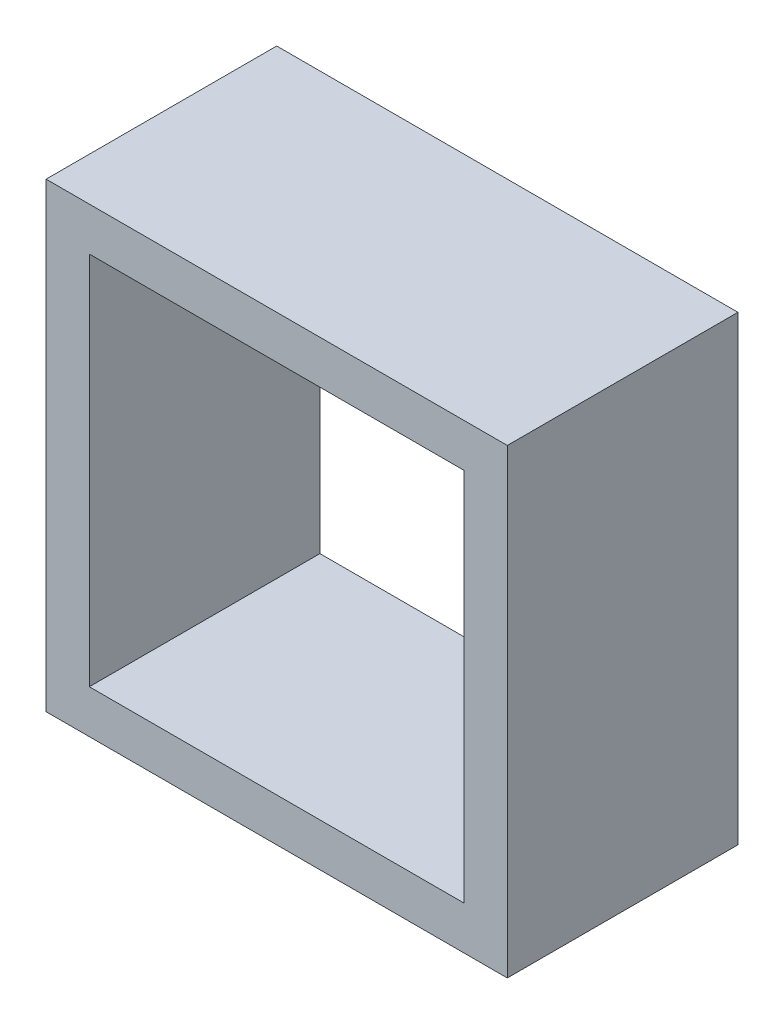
ISO-10303-21;
HEADER;
FILE_DESCRIPTION(('STEP AP214'),'2;1');
FILE_NAME('part.step','',(''),(''),'','','');
FILE_SCHEMA(('AUTOMOTIVE_DESIGN { 1 0 10303 214 1 1 1 1 }'));
ENDSEC;
DATA;
#1=APPLICATION_CONTEXT('core data for automotive mechanical design processes');
#2=APPLICATION_PROTOCOL_DEFINITION('international standard','automotive_design',2000,#1);
#3=PRODUCT_CONTEXT('',#1,'mechanical');
#4=PRODUCT('Part','Part','',(#3));
#5=PRODUCT_RELATED_PRODUCT_CATEGORY('part','',(#4));
#6=PRODUCT_DEFINITION_FORMATION('','',#4);
#7=PRODUCT_DEFINITION_CONTEXT('part definition',#1,'design');
#8=PRODUCT_DEFINITION('design','',#6,#7);
#9=PRODUCT_DEFINITION_SHAPE('','',#8);
#10=(LENGTH_UNIT() NAMED_UNIT(*) SI_UNIT(.MILLI.,.METRE.));
#11=(NAMED_UNIT(*) PLANE_ANGLE_UNIT() SI_UNIT($,.RADIAN.));
#12=(NAMED_UNIT(*) SI_UNIT($,.STERADIAN.) SOLID_ANGLE_UNIT());
#13=UNCERTAINTY_MEASURE_WITH_UNIT(LENGTH_MEASURE(1.E-05),#10,'distance_accuracy_value','');
#14=(GEOMETRIC_REPRESENTATION_CONTEXT(3) GLOBAL_UNCERTAINTY_ASSIGNED_CONTEXT((#13)) GLOBAL_UNIT_ASSIGNED_CONTEXT((#10,
#11,#12)) REPRESENTATION_CONTEXT('',''));
#15=CARTESIAN_POINT('',(0.,0.,0.));
#16=DIRECTION('',(0.,0.,1.));
#17=DIRECTION('',(1.,0.,0.));
#18=AXIS2_PLACEMENT_3D('',#15,#16,#17);
#19=CARTESIAN_POINT('',(50.799956,50.799956,12.7));
#20=DIRECTION('',(0.,0.,-1.));
#21=DIRECTION('',(-1.,0.,0.));
#22=AXIS2_PLACEMENT_3D('',#19,#20,#21);
#23=PLANE('',#22);
#24=DIRECTION('',(0.,1.,0.));
#25=VECTOR('',#24,1.);
#26=CARTESIAN_POINT('',(50.799956,50.799956,12.7));
#27=LINE('',#26,#25);
#28=CARTESIAN_POINT('',(50.7999560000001,0.,12.7));
#29=VERTEX_POINT('',#28);
#30=CARTESIAN_POINT('',(50.799956,50.799956,12.7));
#31=VERTEX_POINT('',#30);
#32=EDGE_CURVE('E133',#29,#31,#27,.T.);
#33=ORIENTED_EDGE('',*,*,#32,.T.);
#34=DIRECTION('',(-1.,0.,0.));
#35=VECTOR('',#34,1.);
#36=CARTESIAN_POINT('',(50.799956,50.799956,12.7));
#37=LINE('',#36,#35);
#38=CARTESIAN_POINT('',(0.,50.799956,12.7));
#39=VERTEX_POINT('',#38);
#40=EDGE_CURVE('E136',#31,#39,#37,.T.);
#41=ORIENTED_EDGE('',*,*,#40,.T.);
#42=DIRECTION('',(0.,-1.,0.));
#43=VECTOR('',#42,1.);
#44=CARTESIAN_POINT('',(0.,0.,12.7));
#45=LINE('',#44,#43);
#46=CARTESIAN_POINT('',(0.,0.,12.7));
#47=VERTEX_POINT('',#46);
#48=EDGE_CURVE('E139',#39,#47,#45,.T.);
#49=ORIENTED_EDGE('',*,*,#48,.T.);
#50=DIRECTION('',(1.,0.,0.));
#51=VECTOR('',#50,1.);
#52=CARTESIAN_POINT('',(0.,0.,12.7));
#53=LINE('',#52,#51);
#54=EDGE_CURVE('E141',#47,#29,#53,.T.);
#55=ORIENTED_EDGE('',*,*,#54,.T.);
#56=EDGE_LOOP('',(#33,#41,#49,#55));
#57=FACE_BOUND('',#56,.T.);
#58=DIRECTION('',(1.,0.,0.));
#59=VECTOR('',#58,1.);
#60=CARTESIAN_POINT('',(4.7625,4.7625,12.7));
#61=LINE('',#60,#59);
#62=CARTESIAN_POINT('',(4.7625,4.7625,12.7));
#63=VERTEX_POINT('',#62);
#64=CARTESIAN_POINT('',(46.0374560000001,4.7625,12.7));
#65=VERTEX_POINT('',#64);
#66=EDGE_CURVE('E97',#63,#65,#61,.T.);
#67=ORIENTED_EDGE('',*,*,#66,.F.);
#68=DIRECTION('',(0.,-1.,0.));
#69=VECTOR('',#68,1.);
#70=CARTESIAN_POINT('',(4.7625,4.7625,12.7));
#71=LINE('',#70,#69);
#72=CARTESIAN_POINT('',(4.7625,46.037456,12.7));
#73=VERTEX_POINT('',#72);
#74=EDGE_CURVE('E119',#73,#63,#71,.T.);
#75=ORIENTED_EDGE('',*,*,#74,.F.);
#76=DIRECTION('',(-1.,0.,0.));
#77=VECTOR('',#76,1.);
#78=CARTESIAN_POINT('',(46.037456,46.037456,12.7));
#79=LINE('',#78,#77);
#80=CARTESIAN_POINT('',(46.037456,46.037456,12.7));
#81=VERTEX_POINT('',#80);
#82=EDGE_CURVE('E117',#81,#73,#79,.T.);
#83=ORIENTED_EDGE('',*,*,#82,.F.);
#84=DIRECTION('',(0.,1.,0.));
#85=VECTOR('',#84,1.);
#86=CARTESIAN_POINT('',(46.037456,46.037456,12.7));
#87=LINE('',#86,#85);
#88=EDGE_CURVE('E105',#65,#81,#87,.T.);
#89=ORIENTED_EDGE('',*,*,#88,.F.);
#90=EDGE_LOOP('',(#67,#75,#83,#89));
#91=FACE_BOUND('',#90,.T.);
#92=ADVANCED_FACE('F32',(#57,#91),#23,.F.);
#93=CARTESIAN_POINT('',(50.799956,50.799956,-12.7));
#94=DIRECTION('',(0.,0.,-1.));
#95=DIRECTION('',(-1.,0.,0.));
#96=AXIS2_PLACEMENT_3D('',#93,#94,#95);
#97=PLANE('',#96);
#98=DIRECTION('',(0.,1.,0.));
#99=VECTOR('',#98,1.);
#100=CARTESIAN_POINT('',(50.799956,50.799956,-12.7));
#101=LINE('',#100,#99);
#102=CARTESIAN_POINT('',(50.7999560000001,0.,-12.7));
#103=VERTEX_POINT('',#102);
#104=CARTESIAN_POINT('',(50.799956,50.799956,-12.7));
#105=VERTEX_POINT('',#104);
#106=EDGE_CURVE('E113',#103,#105,#101,.T.);
#107=ORIENTED_EDGE('',*,*,#106,.F.);
#108=DIRECTION('',(1.,0.,0.));
#109=VECTOR('',#108,1.);
#110=CARTESIAN_POINT('',(0.,0.,-12.7));
#111=LINE('',#110,#109);
#112=CARTESIAN_POINT('',(0.,0.,-12.7));
#113=VERTEX_POINT('',#112);
#114=EDGE_CURVE('E137',#113,#103,#111,.T.);
#115=ORIENTED_EDGE('',*,*,#114,.F.);
#116=DIRECTION('',(0.,-1.,0.));
#117=VECTOR('',#116,1.);
#118=CARTESIAN_POINT('',(0.,0.,-12.7));
#119=LINE('',#118,#117);
#120=CARTESIAN_POINT('',(0.,50.799956,-12.7));
#121=VERTEX_POINT('',#120);
#122=EDGE_CURVE('E148',#121,#113,#119,.T.);
#123=ORIENTED_EDGE('',*,*,#122,.F.);
#124=DIRECTION('',(-1.,0.,0.));
#125=VECTOR('',#124,1.);
#126=CARTESIAN_POINT('',(50.799956,50.799956,-12.7));
#127=LINE('',#126,#125);
#128=EDGE_CURVE('E146',#105,#121,#127,.T.);
#129=ORIENTED_EDGE('',*,*,#128,.F.);
#130=EDGE_LOOP('',(#107,#115,#123,#129));
#131=FACE_BOUND('',#130,.T.);
#132=DIRECTION('',(0.,-1.,0.));
#133=VECTOR('',#132,1.);
#134=CARTESIAN_POINT('',(4.7625,4.7625,-12.7));
#135=LINE('',#134,#133);
#136=CARTESIAN_POINT('',(4.7625,46.037456,-12.7));
#137=VERTEX_POINT('',#136);
#138=CARTESIAN_POINT('',(4.7625,4.7625,-12.7));
#139=VERTEX_POINT('',#138);
#140=EDGE_CURVE('E106',#137,#139,#135,.T.);
#141=ORIENTED_EDGE('',*,*,#140,.T.);
#142=DIRECTION('',(1.,0.,0.));
#143=VECTOR('',#142,1.);
#144=CARTESIAN_POINT('',(4.7625,4.7625,-12.7));
#145=LINE('',#144,#143);
#146=CARTESIAN_POINT('',(46.0374560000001,4.7625,-12.7));
#147=VERTEX_POINT('',#146);
#148=EDGE_CURVE('E55',#139,#147,#145,.T.);
#149=ORIENTED_EDGE('',*,*,#148,.T.);
#150=DIRECTION('',(0.,1.,0.));
#151=VECTOR('',#150,1.);
#152=CARTESIAN_POINT('',(46.037456,46.037456,-12.7));
#153=LINE('',#152,#151);
#154=CARTESIAN_POINT('',(46.037456,46.037456,-12.7));
#155=VERTEX_POINT('',#154);
#156=EDGE_CURVE('E112',#147,#155,#153,.T.);
#157=ORIENTED_EDGE('',*,*,#156,.T.);
#158=DIRECTION('',(-1.,0.,0.));
#159=VECTOR('',#158,1.);
#160=CARTESIAN_POINT('',(46.037456,46.037456,-12.7));
#161=LINE('',#160,#159);
#162=EDGE_CURVE('E125',#155,#137,#161,.T.);
#163=ORIENTED_EDGE('',*,*,#162,.T.);
#164=EDGE_LOOP('',(#141,#149,#157,#163));
#165=FACE_BOUND('',#164,.T.);
#166=ADVANCED_FACE('F166',(#131,#165),#97,.T.);
#167=CARTESIAN_POINT('',(50.799956,50.799956,12.7));
#168=DIRECTION('',(-1.,0.,0.));
#169=DIRECTION('',(0.,-1.,0.));
#170=AXIS2_PLACEMENT_3D('',#167,#168,#169);
#171=PLANE('',#170);
#172=ORIENTED_EDGE('',*,*,#106,.T.);
#173=DIRECTION('',(0.,0.,-1.));
#174=VECTOR('',#173,1.);
#175=CARTESIAN_POINT('',(50.799956,50.799956,12.7));
#176=LINE('',#175,#174);
#177=EDGE_CURVE('E11',#31,#105,#176,.T.);
#178=ORIENTED_EDGE('',*,*,#177,.F.);
#179=ORIENTED_EDGE('',*,*,#32,.F.);
#180=DIRECTION('',(0.,0.,-1.));
#181=VECTOR('',#180,1.);
#182=CARTESIAN_POINT('',(50.7999560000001,0.,12.7));
#183=LINE('',#182,#181);
#184=EDGE_CURVE('E143',#29,#103,#183,.T.);
#185=ORIENTED_EDGE('',*,*,#184,.T.);
#186=EDGE_LOOP('',(#172,#178,#179,#185));
#187=FACE_BOUND('',#186,.T.);
#188=ADVANCED_FACE('F34',(#187),#171,.F.);
#189=CARTESIAN_POINT('',(50.799956,50.799956,12.7));
#190=DIRECTION('',(0.,-1.,0.));
#191=DIRECTION('',(1.,0.,0.));
#192=AXIS2_PLACEMENT_3D('',#189,#190,#191);
#193=PLANE('',#192);
#194=ORIENTED_EDGE('',*,*,#128,.T.);
#195=DIRECTION('',(0.,0.,-1.));
#196=VECTOR('',#195,1.);
#197=CARTESIAN_POINT('',(0.,50.799956,12.7));
#198=LINE('',#197,#196);
#199=EDGE_CURVE('E40',#39,#121,#198,.T.);
#200=ORIENTED_EDGE('',*,*,#199,.F.);
#201=ORIENTED_EDGE('',*,*,#40,.F.);
#202=ORIENTED_EDGE('',*,*,#177,.T.);
#203=EDGE_LOOP('',(#194,#200,#201,#202));
#204=FACE_BOUND('',#203,.T.);
#205=ADVANCED_FACE('F176',(#204),#193,.F.);
#206=CARTESIAN_POINT('',(0.,0.,12.7));
#207=DIRECTION('',(1.,0.,0.));
#208=DIRECTION('',(0.,0.,-1.));
#209=AXIS2_PLACEMENT_3D('',#206,#207,#208);
#210=PLANE('',#209);
#211=ORIENTED_EDGE('',*,*,#122,.T.);
#212=DIRECTION('',(0.,0.,-1.));
#213=VECTOR('',#212,1.);
#214=CARTESIAN_POINT('',(0.,0.,12.7));
#215=LINE('',#214,#213);
#216=EDGE_CURVE('E153',#47,#113,#215,.T.);
#217=ORIENTED_EDGE('',*,*,#216,.F.);
#218=ORIENTED_EDGE('',*,*,#48,.F.);
#219=ORIENTED_EDGE('',*,*,#199,.T.);
#220=EDGE_LOOP('',(#211,#217,#218,#219));
#221=FACE_BOUND('',#220,.T.);
#222=ADVANCED_FACE('F160',(#221),#210,.F.);
#223=CARTESIAN_POINT('',(0.,0.,12.7));
#224=DIRECTION('',(0.,1.,0.));
#225=DIRECTION('',(0.,0.,1.));
#226=AXIS2_PLACEMENT_3D('',#223,#224,#225);
#227=PLANE('',#226);
#228=ORIENTED_EDGE('',*,*,#114,.T.);
#229=ORIENTED_EDGE('',*,*,#184,.F.);
#230=ORIENTED_EDGE('',*,*,#54,.F.);
#231=ORIENTED_EDGE('',*,*,#216,.T.);
#232=EDGE_LOOP('',(#228,#229,#230,#231));
#233=FACE_BOUND('',#232,.T.);
#234=ADVANCED_FACE('F170',(#233),#227,.F.);
#235=CARTESIAN_POINT('',(4.7625,4.7625,12.7));
#236=DIRECTION('',(0.,1.,0.));
#237=DIRECTION('',(0.,0.,1.));
#238=AXIS2_PLACEMENT_3D('',#235,#236,#237);
#239=PLANE('',#238);
#240=ORIENTED_EDGE('',*,*,#148,.F.);
#241=DIRECTION('',(0.,0.,-1.));
#242=VECTOR('',#241,1.);
#243=CARTESIAN_POINT('',(4.7625,4.7625,12.7));
#244=LINE('',#243,#242);
#245=EDGE_CURVE('E101',#63,#139,#244,.T.);
#246=ORIENTED_EDGE('',*,*,#245,.F.);
#247=ORIENTED_EDGE('',*,*,#66,.T.);
#248=DIRECTION('',(0.,0.,-1.));
#249=VECTOR('',#248,1.);
#250=CARTESIAN_POINT('',(46.0374560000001,4.7625,12.7));
#251=LINE('',#250,#249);
#252=EDGE_CURVE('E100',#65,#147,#251,.T.);
#253=ORIENTED_EDGE('',*,*,#252,.T.);
#254=EDGE_LOOP('',(#240,#246,#247,#253));
#255=FACE_BOUND('',#254,.T.);
#256=ADVANCED_FACE('F99',(#255),#239,.T.);
#257=CARTESIAN_POINT('',(46.037456,46.037456,12.7));
#258=DIRECTION('',(-1.,0.,0.));
#259=DIRECTION('',(0.,-1.,0.));
#260=AXIS2_PLACEMENT_3D('',#257,#258,#259);
#261=PLANE('',#260);
#262=ORIENTED_EDGE('',*,*,#156,.F.);
#263=ORIENTED_EDGE('',*,*,#252,.F.);
#264=ORIENTED_EDGE('',*,*,#88,.T.);
#265=DIRECTION('',(0.,0.,-1.));
#266=VECTOR('',#265,1.);
#267=CARTESIAN_POINT('',(46.037456,46.037456,12.7));
#268=LINE('',#267,#266);
#269=EDGE_CURVE('E114',#81,#155,#268,.T.);
#270=ORIENTED_EDGE('',*,*,#269,.T.);
#271=EDGE_LOOP('',(#262,#263,#264,#270));
#272=FACE_BOUND('',#271,.T.);
#273=ADVANCED_FACE('F109',(#272),#261,.T.);
#274=CARTESIAN_POINT('',(46.037456,46.037456,12.7));
#275=DIRECTION('',(0.,-1.,0.));
#276=DIRECTION('',(1.,0.,0.));
#277=AXIS2_PLACEMENT_3D('',#274,#275,#276);
#278=PLANE('',#277);
#279=ORIENTED_EDGE('',*,*,#162,.F.);
#280=ORIENTED_EDGE('',*,*,#269,.F.);
#281=ORIENTED_EDGE('',*,*,#82,.T.);
#282=DIRECTION('',(0.,0.,-1.));
#283=VECTOR('',#282,1.);
#284=CARTESIAN_POINT('',(4.7625,46.037456,12.7));
#285=LINE('',#284,#283);
#286=EDGE_CURVE('E47',#73,#137,#285,.T.);
#287=ORIENTED_EDGE('',*,*,#286,.T.);
#288=EDGE_LOOP('',(#279,#280,#281,#287));
#289=FACE_BOUND('',#288,.T.);
#290=ADVANCED_FACE('F199',(#289),#278,.T.);
#291=CARTESIAN_POINT('',(4.7625,4.7625,12.7));
#292=DIRECTION('',(1.,0.,0.));
#293=DIRECTION('',(0.,0.,-1.));
#294=AXIS2_PLACEMENT_3D('',#291,#292,#293);
#295=PLANE('',#294);
#296=ORIENTED_EDGE('',*,*,#140,.F.);
#297=ORIENTED_EDGE('',*,*,#286,.F.);
#298=ORIENTED_EDGE('',*,*,#74,.T.);
#299=ORIENTED_EDGE('',*,*,#245,.T.);
#300=EDGE_LOOP('',(#296,#297,#298,#299));
#301=FACE_BOUND('',#300,.T.);
#302=ADVANCED_FACE('F203',(#301),#295,.T.);
#303=CLOSED_SHELL('',(#92,#166,#188,#205,#222,#234,#256,#273,#290,#302));
#304=MANIFOLD_SOLID_BREP('B2',#303);
#305=ADVANCED_BREP_SHAPE_REPRESENTATION('',(#18,#304),#14);
#306=SHAPE_DEFINITION_REPRESENTATION(#9,#305);
ENDSEC;
END-ISO-10303-21;
